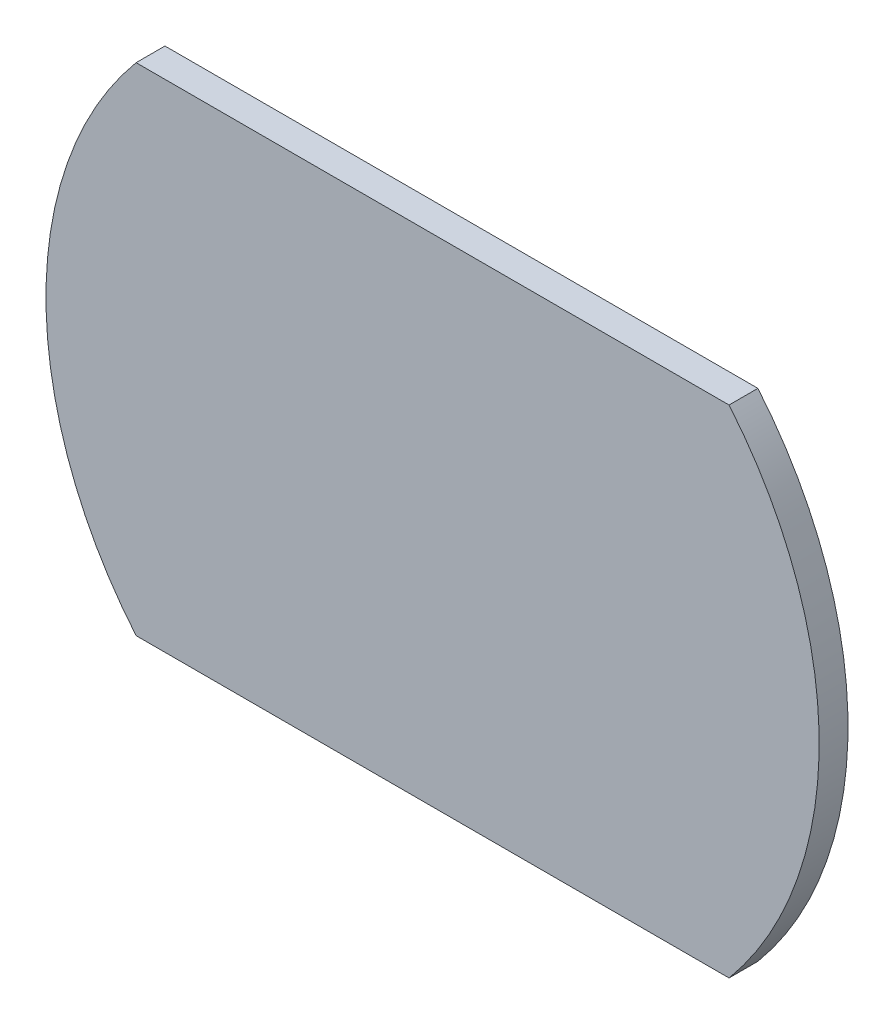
ISO-10303-21;
HEADER;
FILE_DESCRIPTION(('STEP AP214'),'2;1');
FILE_NAME('part.step','',(''),(''),'','','');
FILE_SCHEMA(('AUTOMOTIVE_DESIGN { 1 0 10303 214 1 1 1 1 }'));
ENDSEC;
DATA;
#1=APPLICATION_CONTEXT('core data for automotive mechanical design processes');
#2=APPLICATION_PROTOCOL_DEFINITION('international standard','automotive_design',2000,#1);
#3=PRODUCT_CONTEXT('',#1,'mechanical');
#4=PRODUCT('Part','Part','',(#3));
#5=PRODUCT_RELATED_PRODUCT_CATEGORY('part','',(#4));
#6=PRODUCT_DEFINITION_FORMATION('','',#4);
#7=PRODUCT_DEFINITION_CONTEXT('part definition',#1,'design');
#8=PRODUCT_DEFINITION('design','',#6,#7);
#9=PRODUCT_DEFINITION_SHAPE('','',#8);
#10=(LENGTH_UNIT() NAMED_UNIT(*) SI_UNIT(.MILLI.,.METRE.));
#11=(NAMED_UNIT(*) PLANE_ANGLE_UNIT() SI_UNIT($,.RADIAN.));
#12=(NAMED_UNIT(*) SI_UNIT($,.STERADIAN.) SOLID_ANGLE_UNIT());
#13=UNCERTAINTY_MEASURE_WITH_UNIT(LENGTH_MEASURE(1.E-05),#10,'distance_accuracy_value','');
#14=(GEOMETRIC_REPRESENTATION_CONTEXT(3) GLOBAL_UNCERTAINTY_ASSIGNED_CONTEXT((#13)) GLOBAL_UNIT_ASSIGNED_CONTEXT((#10,
#11,#12)) REPRESENTATION_CONTEXT('',''));
#15=CARTESIAN_POINT('',(0.,0.,0.));
#16=DIRECTION('',(0.,0.,1.));
#17=DIRECTION('',(1.,0.,0.));
#18=AXIS2_PLACEMENT_3D('',#15,#16,#17);
#19=CARTESIAN_POINT('',(-6.5253781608,-5.461,0.));
#20=DIRECTION('',(0.,1.,0.));
#21=DIRECTION('',(0.,0.,1.));
#22=AXIS2_PLACEMENT_3D('',#19,#20,#21);
#23=PLANE('',#22);
#24=DIRECTION('',(0.,0.,1.));
#25=VECTOR('',#24,1.);
#26=CARTESIAN_POINT('',(-6.5253781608,-5.461,0.3175));
#27=LINE('',#26,#25);
#28=CARTESIAN_POINT('',(-6.52537815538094,-5.461,0.));
#29=VERTEX_POINT('',#28);
#30=CARTESIAN_POINT('',(-6.52537815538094,-5.461,0.635));
#31=VERTEX_POINT('',#30);
#32=EDGE_CURVE('E34',#29,#31,#27,.T.);
#33=ORIENTED_EDGE('',*,*,#32,.F.);
#34=DIRECTION('',(1.,0.,0.));
#35=VECTOR('',#34,1.);
#36=CARTESIAN_POINT('',(0.,-5.461,0.));
#37=LINE('',#36,#35);
#38=CARTESIAN_POINT('',(6.52537815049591,-5.46099999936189,0.));
#39=VERTEX_POINT('',#38);
#40=EDGE_CURVE('E62',#29,#39,#37,.T.);
#41=ORIENTED_EDGE('',*,*,#40,.T.);
#42=DIRECTION('',(0.,0.,-1.));
#43=VECTOR('',#42,1.);
#44=CARTESIAN_POINT('',(6.52537815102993,-5.46099999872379,0.3175));
#45=LINE('',#44,#43);
#46=CARTESIAN_POINT('',(6.52537815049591,-5.46099999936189,0.635));
#47=VERTEX_POINT('',#46);
#48=EDGE_CURVE('E74',#39,#47,#45,.F.);
#49=ORIENTED_EDGE('',*,*,#48,.T.);
#50=DIRECTION('',(1.,0.,0.));
#51=VECTOR('',#50,1.);
#52=CARTESIAN_POINT('',(0.,-5.461,0.635));
#53=LINE('',#52,#51);
#54=EDGE_CURVE('E81',#31,#47,#53,.T.);
#55=ORIENTED_EDGE('',*,*,#54,.F.);
#56=EDGE_LOOP('',(#33,#41,#49,#55));
#57=FACE_BOUND('',#56,.T.);
#58=ADVANCED_FACE('F15',(#57),#23,.F.);
#59=CARTESIAN_POINT('',(0.,0.,0.635));
#60=DIRECTION('',(0.,0.,-1.));
#61=DIRECTION('',(-1.,0.,0.));
#62=AXIS2_PLACEMENT_3D('',#59,#60,#61);
#63=CYLINDRICAL_SURFACE('',#62,8.509);
#64=ORIENTED_EDGE('',*,*,#48,.F.);
#65=CARTESIAN_POINT('',(0.,0.,0.));
#66=DIRECTION('',(0.,0.,-1.));
#67=DIRECTION('',(-1.,0.,0.));
#68=AXIS2_PLACEMENT_3D('',#65,#66,#67);
#69=CIRCLE('',#68,8.509);
#70=CARTESIAN_POINT('',(6.52537815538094,5.461,0.));
#71=VERTEX_POINT('',#70);
#72=EDGE_CURVE('E19',#39,#71,#69,.F.);
#73=ORIENTED_EDGE('',*,*,#72,.T.);
#74=DIRECTION('',(0.,0.,1.));
#75=VECTOR('',#74,1.);
#76=CARTESIAN_POINT('',(6.5253781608,5.461,0.3175));
#77=LINE('',#76,#75);
#78=CARTESIAN_POINT('',(6.52537815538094,5.461,0.635));
#79=VERTEX_POINT('',#78);
#80=EDGE_CURVE('E53',#71,#79,#77,.T.);
#81=ORIENTED_EDGE('',*,*,#80,.T.);
#82=CARTESIAN_POINT('',(0.,0.,0.635));
#83=DIRECTION('',(0.,0.,-1.));
#84=DIRECTION('',(-1.,0.,0.));
#85=AXIS2_PLACEMENT_3D('',#82,#83,#84);
#86=CIRCLE('',#85,8.509);
#87=EDGE_CURVE('E79',#47,#79,#86,.F.);
#88=ORIENTED_EDGE('',*,*,#87,.F.);
#89=EDGE_LOOP('',(#64,#73,#81,#88));
#90=FACE_BOUND('',#89,.T.);
#91=ADVANCED_FACE('F89',(#90),#63,.T.);
#92=CARTESIAN_POINT('',(-6.5253781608,5.461,0.635));
#93=DIRECTION('',(0.,-1.,0.));
#94=DIRECTION('',(0.,0.,-1.));
#95=AXIS2_PLACEMENT_3D('',#92,#93,#94);
#96=PLANE('',#95);
#97=ORIENTED_EDGE('',*,*,#80,.F.);
#98=DIRECTION('',(-1.,0.,0.));
#99=VECTOR('',#98,1.);
#100=CARTESIAN_POINT('',(0.,5.461,0.));
#101=LINE('',#100,#99);
#102=CARTESIAN_POINT('',(-6.52537814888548,5.46100000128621,0.));
#103=VERTEX_POINT('',#102);
#104=EDGE_CURVE('E61',#71,#103,#101,.T.);
#105=ORIENTED_EDGE('',*,*,#104,.T.);
#106=DIRECTION('',(0.,0.,-1.));
#107=VECTOR('',#106,1.);
#108=CARTESIAN_POINT('',(-6.52537814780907,5.46100000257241,0.3175));
#109=LINE('',#108,#107);
#110=CARTESIAN_POINT('',(-6.52537814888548,5.46100000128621,0.635));
#111=VERTEX_POINT('',#110);
#112=EDGE_CURVE('E69',#103,#111,#109,.F.);
#113=ORIENTED_EDGE('',*,*,#112,.T.);
#114=DIRECTION('',(-1.,0.,0.));
#115=VECTOR('',#114,1.);
#116=CARTESIAN_POINT('',(0.,5.461,0.635));
#117=LINE('',#116,#115);
#118=EDGE_CURVE('E65',#79,#111,#117,.T.);
#119=ORIENTED_EDGE('',*,*,#118,.F.);
#120=EDGE_LOOP('',(#97,#105,#113,#119));
#121=FACE_BOUND('',#120,.T.);
#122=ADVANCED_FACE('F68',(#121),#96,.F.);
#123=CARTESIAN_POINT('',(-8.611108,-5.461,0.));
#124=DIRECTION('',(0.,0.,1.));
#125=DIRECTION('',(1.,0.,0.));
#126=AXIS2_PLACEMENT_3D('',#123,#124,#125);
#127=PLANE('',#126);
#128=ORIENTED_EDGE('',*,*,#40,.F.);
#129=CARTESIAN_POINT('',(0.,0.,0.));
#130=DIRECTION('',(0.,0.,-1.));
#131=DIRECTION('',(-1.,0.,0.));
#132=AXIS2_PLACEMENT_3D('',#129,#130,#131);
#133=CIRCLE('',#132,8.509);
#134=EDGE_CURVE('E25',#29,#103,#133,.T.);
#135=ORIENTED_EDGE('',*,*,#134,.T.);
#136=ORIENTED_EDGE('',*,*,#104,.F.);
#137=ORIENTED_EDGE('',*,*,#72,.F.);
#138=EDGE_LOOP('',(#128,#135,#136,#137));
#139=FACE_BOUND('',#138,.T.);
#140=ADVANCED_FACE('F59',(#139),#127,.F.);
#141=CARTESIAN_POINT('',(-8.611108,-5.461,0.635));
#142=DIRECTION('',(0.,0.,1.));
#143=DIRECTION('',(1.,0.,0.));
#144=AXIS2_PLACEMENT_3D('',#141,#142,#143);
#145=PLANE('',#144);
#146=ORIENTED_EDGE('',*,*,#118,.T.);
#147=CARTESIAN_POINT('',(0.,0.,0.635));
#148=DIRECTION('',(0.,0.,-1.));
#149=DIRECTION('',(-1.,0.,0.));
#150=AXIS2_PLACEMENT_3D('',#147,#148,#149);
#151=CIRCLE('',#150,8.509);
#152=EDGE_CURVE('E10',#111,#31,#151,.F.);
#153=ORIENTED_EDGE('',*,*,#152,.T.);
#154=ORIENTED_EDGE('',*,*,#54,.T.);
#155=ORIENTED_EDGE('',*,*,#87,.T.);
#156=EDGE_LOOP('',(#146,#153,#154,#155));
#157=FACE_BOUND('',#156,.T.);
#158=ADVANCED_FACE('F17',(#157),#145,.T.);
#159=CARTESIAN_POINT('',(0.,0.,0.635));
#160=DIRECTION('',(0.,0.,-1.));
#161=DIRECTION('',(-1.,0.,0.));
#162=AXIS2_PLACEMENT_3D('',#159,#160,#161);
#163=CYLINDRICAL_SURFACE('',#162,8.509);
#164=ORIENTED_EDGE('',*,*,#152,.F.);
#165=ORIENTED_EDGE('',*,*,#112,.F.);
#166=ORIENTED_EDGE('',*,*,#134,.F.);
#167=ORIENTED_EDGE('',*,*,#32,.T.);
#168=EDGE_LOOP('',(#164,#165,#166,#167));
#169=FACE_BOUND('',#168,.T.);
#170=ADVANCED_FACE('F72',(#169),#163,.T.);
#171=CLOSED_SHELL('',(#58,#91,#122,#140,#158,#170));
#172=MANIFOLD_SOLID_BREP('B1',#171);
#173=ADVANCED_BREP_SHAPE_REPRESENTATION('',(#18,#172),#14);
#174=SHAPE_DEFINITION_REPRESENTATION(#9,#173);
ENDSEC;
END-ISO-10303-21;
